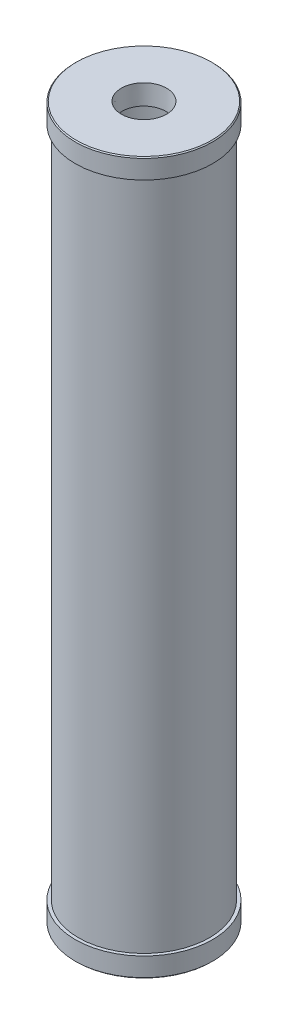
ISO-10303-21;
HEADER;
FILE_DESCRIPTION(('STEP AP214'),'2;1');
FILE_NAME('part.step','',(''),(''),'','','');
FILE_SCHEMA(('AUTOMOTIVE_DESIGN { 1 0 10303 214 1 1 1 1 }'));
ENDSEC;
DATA;
#1=APPLICATION_CONTEXT('core data for automotive mechanical design processes');
#2=APPLICATION_PROTOCOL_DEFINITION('international standard','automotive_design',2000,#1);
#3=PRODUCT_CONTEXT('',#1,'mechanical');
#4=PRODUCT('Part','Part','',(#3));
#5=PRODUCT_RELATED_PRODUCT_CATEGORY('part','',(#4));
#6=PRODUCT_DEFINITION_FORMATION('','',#4);
#7=PRODUCT_DEFINITION_CONTEXT('part definition',#1,'design');
#8=PRODUCT_DEFINITION('design','',#6,#7);
#9=PRODUCT_DEFINITION_SHAPE('','',#8);
#10=(LENGTH_UNIT() NAMED_UNIT(*) SI_UNIT(.MILLI.,.METRE.));
#11=(NAMED_UNIT(*) PLANE_ANGLE_UNIT() SI_UNIT($,.RADIAN.));
#12=(NAMED_UNIT(*) SI_UNIT($,.STERADIAN.) SOLID_ANGLE_UNIT());
#13=UNCERTAINTY_MEASURE_WITH_UNIT(LENGTH_MEASURE(1.E-05),#10,'distance_accuracy_value','');
#14=(GEOMETRIC_REPRESENTATION_CONTEXT(3) GLOBAL_UNCERTAINTY_ASSIGNED_CONTEXT((#13)) GLOBAL_UNIT_ASSIGNED_CONTEXT((#10,
#11,#12)) REPRESENTATION_CONTEXT('',''));
#15=CARTESIAN_POINT('',(0.,0.,0.));
#16=DIRECTION('',(0.,0.,1.));
#17=DIRECTION('',(1.,0.,0.));
#18=AXIS2_PLACEMENT_3D('',#15,#16,#17);
#19=CARTESIAN_POINT('',(0.,25.4,0.));
#20=DIRECTION('',(0.,1.,0.));
#21=DIRECTION('',(0.,0.,1.));
#22=AXIS2_PLACEMENT_3D('',#19,#20,#21);
#23=PLANE('',#22);
#24=CARTESIAN_POINT('',(0.,25.4,0.));
#25=DIRECTION('',(0.,1.,0.));
#26=DIRECTION('',(0.,0.,1.));
#27=AXIS2_PLACEMENT_3D('',#24,#25,#26);
#28=CIRCLE('',#27,28.2731618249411);
#29=CARTESIAN_POINT('',(0.,25.4,28.2731618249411));
#30=VERTEX_POINT('',#29);
#31=EDGE_CURVE('E54',#30,#30,#28,.T.);
#32=ORIENTED_EDGE('',*,*,#31,.F.);
#33=EDGE_LOOP('',(#32));
#34=FACE_BOUND('',#33,.T.);
#35=CARTESIAN_POINT('',(0.,25.4,0.));
#36=DIRECTION('',(0.,1.,0.));
#37=DIRECTION('',(0.,0.,1.));
#38=AXIS2_PLACEMENT_3D('',#35,#36,#37);
#39=CIRCLE('',#38,74.676);
#40=CARTESIAN_POINT('',(0.,25.4,74.676));
#41=VERTEX_POINT('',#40);
#42=EDGE_CURVE('E67',#41,#41,#39,.T.);
#43=ORIENTED_EDGE('',*,*,#42,.T.);
#44=EDGE_LOOP('',(#43));
#45=FACE_BOUND('',#44,.T.);
#46=ADVANCED_FACE('F33',(#34,#45),#23,.T.);
#47=CARTESIAN_POINT('',(0.,914.4,0.));
#48=DIRECTION('',(0.,-1.,0.));
#49=DIRECTION('',(0.,0.,-1.));
#50=AXIS2_PLACEMENT_3D('',#47,#48,#49);
#51=CYLINDRICAL_SURFACE('',#50,74.676);
#52=ORIENTED_EDGE('',*,*,#42,.F.);
#53=EDGE_LOOP('',(#52));
#54=FACE_BOUND('',#53,.T.);
#55=CARTESIAN_POINT('',(0.,889.,0.));
#56=DIRECTION('',(0.,1.,0.));
#57=DIRECTION('',(0.,0.,1.));
#58=AXIS2_PLACEMENT_3D('',#55,#56,#57);
#59=CIRCLE('',#58,74.676);
#60=CARTESIAN_POINT('',(0.,889.,74.676));
#61=VERTEX_POINT('',#60);
#62=EDGE_CURVE('E63',#61,#61,#59,.T.);
#63=ORIENTED_EDGE('',*,*,#62,.T.);
#64=EDGE_LOOP('',(#63));
#65=FACE_BOUND('',#64,.T.);
#66=ADVANCED_FACE('F106',(#54,#65),#51,.F.);
#67=CARTESIAN_POINT('',(0.,889.,0.));
#68=DIRECTION('',(0.,1.,0.));
#69=DIRECTION('',(0.,0.,1.));
#70=AXIS2_PLACEMENT_3D('',#67,#68,#69);
#71=PLANE('',#70);
#72=CARTESIAN_POINT('',(0.,889.,0.));
#73=DIRECTION('',(0.,1.,0.));
#74=DIRECTION('',(0.,0.,1.));
#75=AXIS2_PLACEMENT_3D('',#72,#73,#74);
#76=CIRCLE('',#75,28.2731618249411);
#77=CARTESIAN_POINT('',(0.,889.,28.2731618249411));
#78=VERTEX_POINT('',#77);
#79=EDGE_CURVE('E59',#78,#78,#76,.T.);
#80=ORIENTED_EDGE('',*,*,#79,.T.);
#81=EDGE_LOOP('',(#80));
#82=FACE_BOUND('',#81,.T.);
#83=ORIENTED_EDGE('',*,*,#62,.F.);
#84=EDGE_LOOP('',(#83));
#85=FACE_BOUND('',#84,.T.);
#86=ADVANCED_FACE('F99',(#82,#85),#71,.F.);
#87=CARTESIAN_POINT('',(0.,914.4,0.));
#88=DIRECTION('',(0.,1.,0.));
#89=DIRECTION('',(0.,0.,1.));
#90=AXIS2_PLACEMENT_3D('',#87,#88,#89);
#91=CONICAL_SURFACE('',#90,29.066064,0.0312064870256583);
#92=CARTESIAN_POINT('',(0.,914.4,0.));
#93=DIRECTION('',(0.,1.,0.));
#94=DIRECTION('',(0.,0.,1.));
#95=AXIS2_PLACEMENT_3D('',#92,#93,#94);
#96=CIRCLE('',#95,29.066064);
#97=CARTESIAN_POINT('',(0.,914.4,29.066064));
#98=VERTEX_POINT('',#97);
#99=EDGE_CURVE('E57',#98,#98,#96,.T.);
#100=ORIENTED_EDGE('',*,*,#99,.T.);
#101=EDGE_LOOP('',(#100));
#102=FACE_BOUND('',#101,.T.);
#103=ORIENTED_EDGE('',*,*,#79,.F.);
#104=EDGE_LOOP('',(#103));
#105=FACE_BOUND('',#104,.T.);
#106=ADVANCED_FACE('F123',(#102,#105),#91,.F.);
#107=CARTESIAN_POINT('',(0.,914.4,0.));
#108=DIRECTION('',(0.,-1.,0.));
#109=DIRECTION('',(0.,0.,-1.));
#110=AXIS2_PLACEMENT_3D('',#107,#108,#109);
#111=CYLINDRICAL_SURFACE('',#110,84.201);
#112=CARTESIAN_POINT('',(0.,25.4,0.));
#113=DIRECTION('',(0.,1.,0.));
#114=DIRECTION('',(0.,0.,1.));
#115=AXIS2_PLACEMENT_3D('',#112,#113,#114);
#116=CIRCLE('',#115,84.201);
#117=CARTESIAN_POINT('',(0.,25.4,84.201));
#118=VERTEX_POINT('',#117);
#119=EDGE_CURVE('E70',#118,#118,#116,.T.);
#120=ORIENTED_EDGE('',*,*,#119,.T.);
#121=EDGE_LOOP('',(#120));
#122=FACE_BOUND('',#121,.T.);
#123=CARTESIAN_POINT('',(0.,889.,0.));
#124=DIRECTION('',(0.,1.,0.));
#125=DIRECTION('',(0.,0.,1.));
#126=AXIS2_PLACEMENT_3D('',#123,#124,#125);
#127=CIRCLE('',#126,84.201);
#128=CARTESIAN_POINT('',(0.,889.,84.201));
#129=VERTEX_POINT('',#128);
#130=EDGE_CURVE('E53',#129,#129,#127,.T.);
#131=ORIENTED_EDGE('',*,*,#130,.F.);
#132=EDGE_LOOP('',(#131));
#133=FACE_BOUND('',#132,.T.);
#134=ADVANCED_FACE('F118',(#122,#133),#111,.T.);
#135=CARTESIAN_POINT('',(0.,25.4,0.));
#136=DIRECTION('',(0.,1.,0.));
#137=DIRECTION('',(0.,0.,1.));
#138=AXIS2_PLACEMENT_3D('',#135,#136,#137);
#139=CIRCLE('',#138,88.265);
#140=CARTESIAN_POINT('',(0.,25.4,88.265));
#141=VERTEX_POINT('',#140);
#142=EDGE_CURVE('E66',#141,#141,#139,.T.);
#143=ORIENTED_EDGE('',*,*,#142,.T.);
#144=EDGE_LOOP('',(#143));
#145=FACE_BOUND('',#144,.T.);
#146=ORIENTED_EDGE('',*,*,#119,.F.);
#147=EDGE_LOOP('',(#146));
#148=FACE_BOUND('',#147,.T.);
#149=ADVANCED_FACE('F100',(#145,#148),#23,.T.);
#150=CARTESIAN_POINT('',(0.,25.4,0.));
#151=DIRECTION('',(0.,-1.,0.));
#152=DIRECTION('',(0.,0.,-1.));
#153=AXIS2_PLACEMENT_3D('',#150,#151,#152);
#154=CYLINDRICAL_SURFACE('',#153,88.265);
#155=CARTESIAN_POINT('',(0.,1.26999999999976,0.));
#156=DIRECTION('',(0.,1.,0.));
#157=DIRECTION('',(0.,0.,1.));
#158=AXIS2_PLACEMENT_3D('',#155,#156,#157);
#159=CIRCLE('',#158,88.265);
#160=CARTESIAN_POINT('',(0.,1.26999999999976,88.265));
#161=VERTEX_POINT('',#160);
#162=EDGE_CURVE('E48',#161,#161,#159,.T.);
#163=ORIENTED_EDGE('',*,*,#162,.T.);
#164=EDGE_LOOP('',(#163));
#165=FACE_BOUND('',#164,.T.);
#166=ORIENTED_EDGE('',*,*,#142,.F.);
#167=EDGE_LOOP('',(#166));
#168=FACE_BOUND('',#167,.T.);
#169=ADVANCED_FACE('F89',(#165,#168),#154,.T.);
#170=CARTESIAN_POINT('',(0.,0.,0.));
#171=DIRECTION('',(0.,1.,0.));
#172=DIRECTION('',(0.,0.,1.));
#173=AXIS2_PLACEMENT_3D('',#170,#171,#172);
#174=PLANE('',#173);
#175=CARTESIAN_POINT('',(0.,0.,0.));
#176=DIRECTION('',(0.,1.,0.));
#177=DIRECTION('',(0.,0.,1.));
#178=AXIS2_PLACEMENT_3D('',#175,#176,#177);
#179=CIRCLE('',#178,86.9950000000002);
#180=CARTESIAN_POINT('',(0.,0.,86.9950000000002));
#181=VERTEX_POINT('',#180);
#182=EDGE_CURVE('E44',#181,#181,#179,.F.);
#183=ORIENTED_EDGE('',*,*,#182,.T.);
#184=EDGE_LOOP('',(#183));
#185=FACE_BOUND('',#184,.T.);
#186=CARTESIAN_POINT('',(0.,0.,0.));
#187=DIRECTION('',(0.,-1.,0.));
#188=DIRECTION('',(0.,0.,-1.));
#189=AXIS2_PLACEMENT_3D('',#186,#187,#188);
#190=CIRCLE('',#189,29.066064);
#191=CARTESIAN_POINT('',(0.,0.,-29.066064));
#192=VERTEX_POINT('',#191);
#193=EDGE_CURVE('E58',#192,#192,#190,.T.);
#194=ORIENTED_EDGE('',*,*,#193,.F.);
#195=EDGE_LOOP('',(#194));
#196=FACE_BOUND('',#195,.T.);
#197=ADVANCED_FACE('F86',(#185,#196),#174,.F.);
#198=CARTESIAN_POINT('',(0.,889.,0.));
#199=DIRECTION('',(0.,1.,0.));
#200=DIRECTION('',(0.,0.,1.));
#201=AXIS2_PLACEMENT_3D('',#198,#199,#200);
#202=CIRCLE('',#201,88.265);
#203=CARTESIAN_POINT('',(0.,889.,88.265));
#204=VERTEX_POINT('',#203);
#205=EDGE_CURVE('E62',#204,#204,#202,.T.);
#206=ORIENTED_EDGE('',*,*,#205,.F.);
#207=EDGE_LOOP('',(#206));
#208=FACE_BOUND('',#207,.T.);
#209=ORIENTED_EDGE('',*,*,#130,.T.);
#210=EDGE_LOOP('',(#209));
#211=FACE_BOUND('',#210,.T.);
#212=ADVANCED_FACE('F88',(#208,#211),#71,.F.);
#213=CARTESIAN_POINT('',(0.,889.,0.));
#214=DIRECTION('',(0.,1.,0.));
#215=DIRECTION('',(0.,0.,1.));
#216=AXIS2_PLACEMENT_3D('',#213,#214,#215);
#217=CYLINDRICAL_SURFACE('',#216,88.265);
#218=CARTESIAN_POINT('',(0.,913.13,0.));
#219=DIRECTION('',(0.,1.,0.));
#220=DIRECTION('',(0.,0.,1.));
#221=AXIS2_PLACEMENT_3D('',#218,#219,#220);
#222=CIRCLE('',#221,88.265);
#223=CARTESIAN_POINT('',(0.,913.13,-88.2650000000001));
#224=VERTEX_POINT('',#223);
#225=EDGE_CURVE('E10',#224,#224,#222,.F.);
#226=ORIENTED_EDGE('',*,*,#225,.T.);
#227=EDGE_LOOP('',(#226));
#228=FACE_BOUND('',#227,.T.);
#229=ORIENTED_EDGE('',*,*,#205,.T.);
#230=EDGE_LOOP('',(#229));
#231=FACE_BOUND('',#230,.T.);
#232=ADVANCED_FACE('F96',(#228,#231),#217,.T.);
#233=CARTESIAN_POINT('',(0.,914.4,0.));
#234=DIRECTION('',(0.,1.,0.));
#235=DIRECTION('',(0.,0.,1.));
#236=AXIS2_PLACEMENT_3D('',#233,#234,#235);
#237=PLANE('',#236);
#238=CARTESIAN_POINT('',(0.,914.4,0.));
#239=DIRECTION('',(0.,1.,0.));
#240=DIRECTION('',(0.,0.,1.));
#241=AXIS2_PLACEMENT_3D('',#238,#239,#240);
#242=CIRCLE('',#241,86.9950000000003);
#243=CARTESIAN_POINT('',(0.,914.4,-86.9950000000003));
#244=VERTEX_POINT('',#243);
#245=EDGE_CURVE('E40',#244,#244,#242,.T.);
#246=ORIENTED_EDGE('',*,*,#245,.T.);
#247=EDGE_LOOP('',(#246));
#248=FACE_BOUND('',#247,.T.);
#249=ORIENTED_EDGE('',*,*,#99,.F.);
#250=EDGE_LOOP('',(#249));
#251=FACE_BOUND('',#250,.T.);
#252=ADVANCED_FACE('F145',(#248,#251),#237,.T.);
#253=CARTESIAN_POINT('',(0.,0.,0.));
#254=DIRECTION('',(0.,-1.,0.));
#255=DIRECTION('',(0.,0.,-1.));
#256=AXIS2_PLACEMENT_3D('',#253,#254,#255);
#257=CONICAL_SURFACE('',#256,29.066064,0.0312064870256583);
#258=ORIENTED_EDGE('',*,*,#31,.T.);
#259=EDGE_LOOP('',(#258));
#260=FACE_BOUND('',#259,.T.);
#261=ORIENTED_EDGE('',*,*,#193,.T.);
#262=EDGE_LOOP('',(#261));
#263=FACE_BOUND('',#262,.T.);
#264=ADVANCED_FACE('F84',(#260,#263),#257,.F.);
#265=CARTESIAN_POINT('',(0.,1.26999999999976,0.));
#266=DIRECTION('',(0.,1.,0.));
#267=DIRECTION('',(0.,0.,1.));
#268=AXIS2_PLACEMENT_3D('',#265,#266,#267);
#269=CONICAL_SURFACE('',#268,88.265,0.785398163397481);
#270=ORIENTED_EDGE('',*,*,#182,.F.);
#271=EDGE_LOOP('',(#270));
#272=FACE_BOUND('',#271,.T.);
#273=ORIENTED_EDGE('',*,*,#162,.F.);
#274=EDGE_LOOP('',(#273));
#275=FACE_BOUND('',#274,.T.);
#276=ADVANCED_FACE('F137',(#272,#275),#269,.T.);
#277=CARTESIAN_POINT('',(0.,914.4,0.));
#278=DIRECTION('',(0.,-1.,0.));
#279=DIRECTION('',(0.,0.,-1.));
#280=AXIS2_PLACEMENT_3D('',#277,#278,#279);
#281=CONICAL_SURFACE('',#280,86.9950000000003,0.785398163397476);
#282=CARTESIAN_POINT('',(0.,913.13,-88.2650000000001));
#283=CARTESIAN_POINT('',(0.,913.143229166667,-88.2517708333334));
#284=CARTESIAN_POINT('',(0.,913.156458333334,-88.2385416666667));
#285=CARTESIAN_POINT('',(0.,913.182916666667,-88.2120833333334));
#286=CARTESIAN_POINT('',(0.,913.196145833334,-88.1988541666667));
#287=CARTESIAN_POINT('',(0.,913.222604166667,-88.1723958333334));
#288=CARTESIAN_POINT('',(0.,913.235833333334,-88.1591666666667));
#289=CARTESIAN_POINT('',(0.,913.262291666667,-88.1327083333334));
#290=CARTESIAN_POINT('',(0.,913.275520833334,-88.1194791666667));
#291=CARTESIAN_POINT('',(0.,913.301979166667,-88.0930208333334));
#292=CARTESIAN_POINT('',(0.,913.315208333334,-88.0797916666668));
#293=CARTESIAN_POINT('',(0.,913.341666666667,-88.0533333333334));
#294=CARTESIAN_POINT('',(0.,913.354895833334,-88.0401041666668));
#295=CARTESIAN_POINT('',(0.,913.381354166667,-88.0136458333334));
#296=CARTESIAN_POINT('',(0.,913.394583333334,-88.0004166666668));
#297=CARTESIAN_POINT('',(0.,913.421041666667,-87.9739583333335));
#298=CARTESIAN_POINT('',(0.,913.434270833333,-87.9607291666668));
#299=CARTESIAN_POINT('',(0.,913.460729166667,-87.9342708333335));
#300=CARTESIAN_POINT('',(0.,913.473958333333,-87.9210416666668));
#301=CARTESIAN_POINT('',(0.,913.500416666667,-87.8945833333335));
#302=CARTESIAN_POINT('',(0.,913.513645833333,-87.8813541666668));
#303=CARTESIAN_POINT('',(0.,913.540104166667,-87.8548958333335));
#304=CARTESIAN_POINT('',(0.,913.553333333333,-87.8416666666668));
#305=CARTESIAN_POINT('',(0.,913.579791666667,-87.8152083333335));
#306=CARTESIAN_POINT('',(0.,913.593020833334,-87.8019791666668));
#307=CARTESIAN_POINT('',(0.,913.619479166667,-87.7755208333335));
#308=CARTESIAN_POINT('',(0.,913.632708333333,-87.7622916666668));
#309=CARTESIAN_POINT('',(0.,913.659166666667,-87.7358333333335));
#310=CARTESIAN_POINT('',(0.,913.672395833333,-87.7226041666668));
#311=CARTESIAN_POINT('',(0.,913.698854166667,-87.6961458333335));
#312=CARTESIAN_POINT('',(0.,913.712083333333,-87.6829166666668));
#313=CARTESIAN_POINT('',(0.,913.738541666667,-87.6564583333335));
#314=CARTESIAN_POINT('',(0.,913.751770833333,-87.6432291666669));
#315=CARTESIAN_POINT('',(0.,913.778229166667,-87.6167708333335));
#316=CARTESIAN_POINT('',(0.,913.791458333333,-87.6035416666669));
#317=CARTESIAN_POINT('',(0.,913.817916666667,-87.5770833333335));
#318=CARTESIAN_POINT('',(0.,913.831145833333,-87.5638541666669));
#319=CARTESIAN_POINT('',(0.,913.857604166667,-87.5373958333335));
#320=CARTESIAN_POINT('',(0.,913.870833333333,-87.5241666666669));
#321=CARTESIAN_POINT('',(0.,913.897291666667,-87.4977083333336));
#322=CARTESIAN_POINT('',(0.,913.910520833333,-87.4844791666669));
#323=CARTESIAN_POINT('',(0.,913.936979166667,-87.4580208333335));
#324=CARTESIAN_POINT('',(0.,913.950208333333,-87.4447916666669));
#325=CARTESIAN_POINT('',(0.,913.976666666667,-87.4183333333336));
#326=CARTESIAN_POINT('',(0.,913.989895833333,-87.4051041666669));
#327=CARTESIAN_POINT('',(0.,914.016354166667,-87.3786458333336));
#328=CARTESIAN_POINT('',(0.,914.029583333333,-87.3654166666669));
#329=CARTESIAN_POINT('',(0.,914.056041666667,-87.3389583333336));
#330=CARTESIAN_POINT('',(0.,914.069270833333,-87.3257291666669));
#331=CARTESIAN_POINT('',(0.,914.095729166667,-87.2992708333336));
#332=CARTESIAN_POINT('',(0.,914.108958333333,-87.2860416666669));
#333=CARTESIAN_POINT('',(0.,914.135416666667,-87.2595833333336));
#334=CARTESIAN_POINT('',(0.,914.148645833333,-87.2463541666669));
#335=CARTESIAN_POINT('',(0.,914.175104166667,-87.2198958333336));
#336=CARTESIAN_POINT('',(0.,914.188333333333,-87.2066666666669));
#337=CARTESIAN_POINT('',(0.,914.214791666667,-87.1802083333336));
#338=CARTESIAN_POINT('',(0.,914.228020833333,-87.166979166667));
#339=CARTESIAN_POINT('',(0.,914.254479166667,-87.1405208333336));
#340=CARTESIAN_POINT('',(0.,914.267708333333,-87.1272916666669));
#341=CARTESIAN_POINT('',(0.,914.294166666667,-87.1008333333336));
#342=CARTESIAN_POINT('',(0.,914.307395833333,-87.087604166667));
#343=CARTESIAN_POINT('',(0.,914.333854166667,-87.0611458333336));
#344=CARTESIAN_POINT('',(0.,914.347083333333,-87.047916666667));
#345=CARTESIAN_POINT('',(0.,914.373541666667,-87.0214583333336));
#346=CARTESIAN_POINT('',(0.,914.386770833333,-87.008229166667));
#347=CARTESIAN_POINT('',(0.,914.4,-86.9950000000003));
#348=B_SPLINE_CURVE_WITH_KNOTS('',3,(#282,#283,#284,#285,#286,#287,#288,#289,#290,#291,#292,
#293,#294,#295,#296,#297,#298,#299,#300,#301,#302,#303,#304,#305,#306,#307,#308,#309,#310,#311,
#312,#313,#314,#315,#316,#317,#318,#319,#320,#321,#322,#323,#324,#325,#326,#327,#328,#329,#330,
#331,#332,#333,#334,#335,#336,#337,#338,#339,#340,#341,#342,#343,#344,#345,#346,#347),
.UNSPECIFIED.,.F.,.F.,(4,2,2,2,2,2,2,2,2,2,2,2,2,2,2,2,2,2,2,2,2,2,2,2,2,2,2,2,2,2,2,2,4),(0.,
0.0561266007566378,0.112253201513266,0.168379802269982,0.22450640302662,0.280633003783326,
0.336759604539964,0.39288620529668,0.449012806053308,0.505139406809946,0.561266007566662,
0.61739260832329,0.673519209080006,0.729645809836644,0.785772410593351,0.841899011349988,
0.898025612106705,0.954152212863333,1.01027881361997,1.06640541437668,1.12253201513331,
1.17865861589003,1.23478521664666,1.29091181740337,1.34703841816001,1.40316501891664,
1.45929161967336,1.51541822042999,1.5715448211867,1.62767142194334,1.68379802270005,
1.73992462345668,1.7960512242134),.UNSPECIFIED.);
#349=EDGE_CURVE('BSEAM35',#224,#244,#348,.T.);
#350=ORIENTED_EDGE('',*,*,#225,.F.);
#351=ORIENTED_EDGE('',*,*,#245,.F.);
#352=ORIENTED_EDGE('',*,*,#349,.T.);
#353=ORIENTED_EDGE('',*,*,#349,.F.);
#354=EDGE_LOOP('',(#350,#352,#351,#353));
#355=FACE_BOUND('',#354,.T.);
#356=ADVANCED_FACE('F35',(#355),#281,.T.);
#357=CLOSED_SHELL('',(#46,#66,#86,#106,#134,#149,#169,#197,#212,#232,#252,#264,#276,#356));
#358=MANIFOLD_SOLID_BREP('B2',#357);
#359=ADVANCED_BREP_SHAPE_REPRESENTATION('',(#18,#358),#14);
#360=SHAPE_DEFINITION_REPRESENTATION(#9,#359);
ENDSEC;
END-ISO-10303-21;
